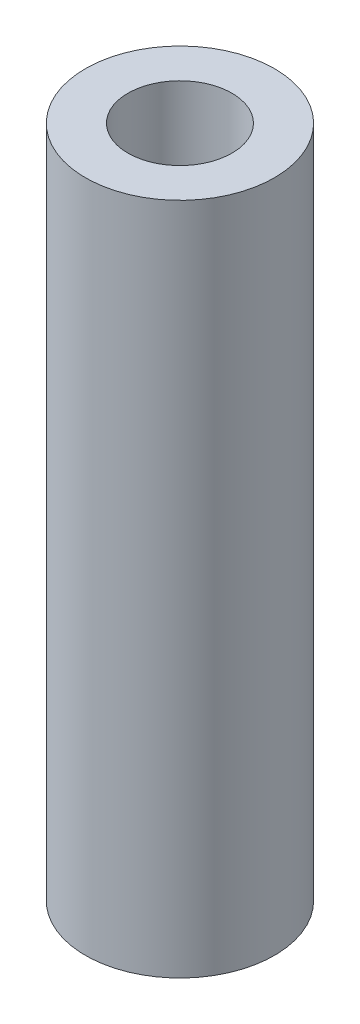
ISO-10303-21;
HEADER;
FILE_DESCRIPTION(('STEP AP214'),'2;1');
FILE_NAME('part.step','',(''),(''),'','','');
FILE_SCHEMA(('AUTOMOTIVE_DESIGN { 1 0 10303 214 1 1 1 1 }'));
ENDSEC;
DATA;
#1=APPLICATION_CONTEXT('core data for automotive mechanical design processes');
#2=APPLICATION_PROTOCOL_DEFINITION('international standard','automotive_design',2000,#1);
#3=PRODUCT_CONTEXT('',#1,'mechanical');
#4=PRODUCT('Part','Part','',(#3));
#5=PRODUCT_RELATED_PRODUCT_CATEGORY('part','',(#4));
#6=PRODUCT_DEFINITION_FORMATION('','',#4);
#7=PRODUCT_DEFINITION_CONTEXT('part definition',#1,'design');
#8=PRODUCT_DEFINITION('design','',#6,#7);
#9=PRODUCT_DEFINITION_SHAPE('','',#8);
#10=(LENGTH_UNIT() NAMED_UNIT(*) SI_UNIT(.MILLI.,.METRE.));
#11=(NAMED_UNIT(*) PLANE_ANGLE_UNIT() SI_UNIT($,.RADIAN.));
#12=(NAMED_UNIT(*) SI_UNIT($,.STERADIAN.) SOLID_ANGLE_UNIT());
#13=UNCERTAINTY_MEASURE_WITH_UNIT(LENGTH_MEASURE(1.E-05),#10,'distance_accuracy_value','');
#14=(GEOMETRIC_REPRESENTATION_CONTEXT(3) GLOBAL_UNCERTAINTY_ASSIGNED_CONTEXT((#13)) GLOBAL_UNIT_ASSIGNED_CONTEXT((#10,
#11,#12)) REPRESENTATION_CONTEXT('',''));
#15=CARTESIAN_POINT('',(0.,0.,0.));
#16=DIRECTION('',(0.,0.,1.));
#17=DIRECTION('',(1.,0.,0.));
#18=AXIS2_PLACEMENT_3D('',#15,#16,#17);
#19=CARTESIAN_POINT('',(0.,33.2499999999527,0.));
#20=DIRECTION('',(0.,1.,0.));
#21=DIRECTION('',(0.,0.,1.));
#22=AXIS2_PLACEMENT_3D('',#19,#20,#21);
#23=CONICAL_SURFACE('',#22,4.39999999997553,1.02974425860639);
#24=CARTESIAN_POINT('',(0.,30.606213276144,0.));
#25=VERTEX_POINT('',#24);
#26=VERTEX_LOOP('',#25);
#27=FACE_BOUND('',#26,.T.);
#28=CARTESIAN_POINT('',(0.,33.25,0.));
#29=DIRECTION('',(0.,1.,0.));
#30=DIRECTION('',(0.,0.,1.));
#31=AXIS2_PLACEMENT_3D('',#28,#29,#30);
#32=CIRCLE('',#31,4.39999999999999);
#33=CARTESIAN_POINT('',(0.,33.25,4.39999999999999));
#34=VERTEX_POINT('',#33);
#35=EDGE_CURVE('E33',#34,#34,#32,.T.);
#36=ORIENTED_EDGE('',*,*,#35,.T.);
#37=EDGE_LOOP('',(#36));
#38=FACE_BOUND('',#37,.T.);
#39=ADVANCED_FACE('F17',(#27,#38),#23,.F.);
#40=CARTESIAN_POINT('',(0.,20.,0.));
#41=DIRECTION('',(0.,-1.,0.));
#42=DIRECTION('',(0.,0.,-1.));
#43=AXIS2_PLACEMENT_3D('',#40,#41,#42);
#44=PLANE('',#43);
#45=CARTESIAN_POINT('',(0.,20.,0.));
#46=DIRECTION('',(0.,-1.,0.));
#47=DIRECTION('',(0.,0.,-1.));
#48=AXIS2_PLACEMENT_3D('',#45,#46,#47);
#49=CIRCLE('',#48,3.5);
#50=CARTESIAN_POINT('',(0.,20.,-3.5));
#51=VERTEX_POINT('',#50);
#52=EDGE_CURVE('E20',#51,#51,#49,.T.);
#53=ORIENTED_EDGE('',*,*,#52,.T.);
#54=EDGE_LOOP('',(#53));
#55=FACE_BOUND('',#54,.T.);
#56=ADVANCED_FACE('F30',(#55),#44,.T.);
#57=CARTESIAN_POINT('',(0.,57.,0.));
#58=DIRECTION('',(0.,1.,0.));
#59=DIRECTION('',(0.,0.,1.));
#60=AXIS2_PLACEMENT_3D('',#57,#58,#59);
#61=CYLINDRICAL_SURFACE('',#60,4.39999999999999);
#62=CARTESIAN_POINT('',(0.,57.,0.));
#63=DIRECTION('',(0.,1.,0.));
#64=DIRECTION('',(0.,0.,1.));
#65=AXIS2_PLACEMENT_3D('',#62,#63,#64);
#66=CIRCLE('',#65,4.39999999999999);
#67=CARTESIAN_POINT('',(0.,57.,4.39999999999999));
#68=VERTEX_POINT('',#67);
#69=EDGE_CURVE('E37',#68,#68,#66,.F.);
#70=ORIENTED_EDGE('',*,*,#69,.F.);
#71=EDGE_LOOP('',(#70));
#72=FACE_BOUND('',#71,.T.);
#73=ORIENTED_EDGE('',*,*,#35,.F.);
#74=EDGE_LOOP('',(#73));
#75=FACE_BOUND('',#74,.T.);
#76=ADVANCED_FACE('F48',(#72,#75),#61,.F.);
#77=CARTESIAN_POINT('',(0.,20.,0.));
#78=DIRECTION('',(0.,-1.,0.));
#79=DIRECTION('',(0.,0.,-1.));
#80=AXIS2_PLACEMENT_3D('',#77,#78,#79);
#81=CYLINDRICAL_SURFACE('',#80,3.5);
#82=ORIENTED_EDGE('',*,*,#52,.F.);
#83=EDGE_LOOP('',(#82));
#84=FACE_BOUND('',#83,.T.);
#85=CARTESIAN_POINT('',(0.,0.,0.));
#86=DIRECTION('',(0.,-1.,0.));
#87=DIRECTION('',(0.,0.,-1.));
#88=AXIS2_PLACEMENT_3D('',#85,#86,#87);
#89=CIRCLE('',#88,3.5);
#90=CARTESIAN_POINT('',(0.,0.,-3.5));
#91=VERTEX_POINT('',#90);
#92=EDGE_CURVE('E41',#91,#91,#89,.T.);
#93=ORIENTED_EDGE('',*,*,#92,.T.);
#94=EDGE_LOOP('',(#93));
#95=FACE_BOUND('',#94,.T.);
#96=ADVANCED_FACE('F50',(#84,#95),#81,.F.);
#97=CARTESIAN_POINT('',(0.,57.,0.));
#98=DIRECTION('',(0.,1.,0.));
#99=DIRECTION('',(0.,0.,1.));
#100=AXIS2_PLACEMENT_3D('',#97,#98,#99);
#101=PLANE('',#100);
#102=CARTESIAN_POINT('',(0.,57.,0.));
#103=DIRECTION('',(0.,-1.,0.));
#104=DIRECTION('',(0.,0.,-1.));
#105=AXIS2_PLACEMENT_3D('',#102,#103,#104);
#106=CIRCLE('',#105,8.);
#107=CARTESIAN_POINT('',(0.,57.,-8.));
#108=VERTEX_POINT('',#107);
#109=EDGE_CURVE('E24',#108,#108,#106,.T.);
#110=ORIENTED_EDGE('',*,*,#109,.F.);
#111=EDGE_LOOP('',(#110));
#112=FACE_BOUND('',#111,.T.);
#113=ORIENTED_EDGE('',*,*,#69,.T.);
#114=EDGE_LOOP('',(#113));
#115=FACE_BOUND('',#114,.T.);
#116=ADVANCED_FACE('F46',(#112,#115),#101,.T.);
#117=CARTESIAN_POINT('',(0.,0.,0.));
#118=DIRECTION('',(0.,1.,0.));
#119=DIRECTION('',(0.,0.,1.));
#120=AXIS2_PLACEMENT_3D('',#117,#118,#119);
#121=PLANE('',#120);
#122=CARTESIAN_POINT('',(0.,0.,0.));
#123=DIRECTION('',(0.,-1.,0.));
#124=DIRECTION('',(0.,0.,-1.));
#125=AXIS2_PLACEMENT_3D('',#122,#123,#124);
#126=CIRCLE('',#125,8.);
#127=CARTESIAN_POINT('',(0.,0.,-8.));
#128=VERTEX_POINT('',#127);
#129=EDGE_CURVE('E11',#128,#128,#126,.F.);
#130=ORIENTED_EDGE('',*,*,#129,.F.);
#131=EDGE_LOOP('',(#130));
#132=FACE_BOUND('',#131,.T.);
#133=ORIENTED_EDGE('',*,*,#92,.F.);
#134=EDGE_LOOP('',(#133));
#135=FACE_BOUND('',#134,.T.);
#136=ADVANCED_FACE('F62',(#132,#135),#121,.F.);
#137=CARTESIAN_POINT('',(0.,57.,0.));
#138=DIRECTION('',(0.,-1.,0.));
#139=DIRECTION('',(0.,0.,-1.));
#140=AXIS2_PLACEMENT_3D('',#137,#138,#139);
#141=CYLINDRICAL_SURFACE('',#140,8.);
#142=ORIENTED_EDGE('',*,*,#129,.T.);
#143=EDGE_LOOP('',(#142));
#144=FACE_BOUND('',#143,.T.);
#145=ORIENTED_EDGE('',*,*,#109,.T.);
#146=EDGE_LOOP('',(#145));
#147=FACE_BOUND('',#146,.T.);
#148=ADVANCED_FACE('F60',(#144,#147),#141,.T.);
#149=CLOSED_SHELL('',(#39,#56,#76,#96,#116,#136,#148));
#150=MANIFOLD_SOLID_BREP('B1',#149);
#151=ADVANCED_BREP_SHAPE_REPRESENTATION('',(#18,#150),#14);
#152=SHAPE_DEFINITION_REPRESENTATION(#9,#151);
ENDSEC;
END-ISO-10303-21;
